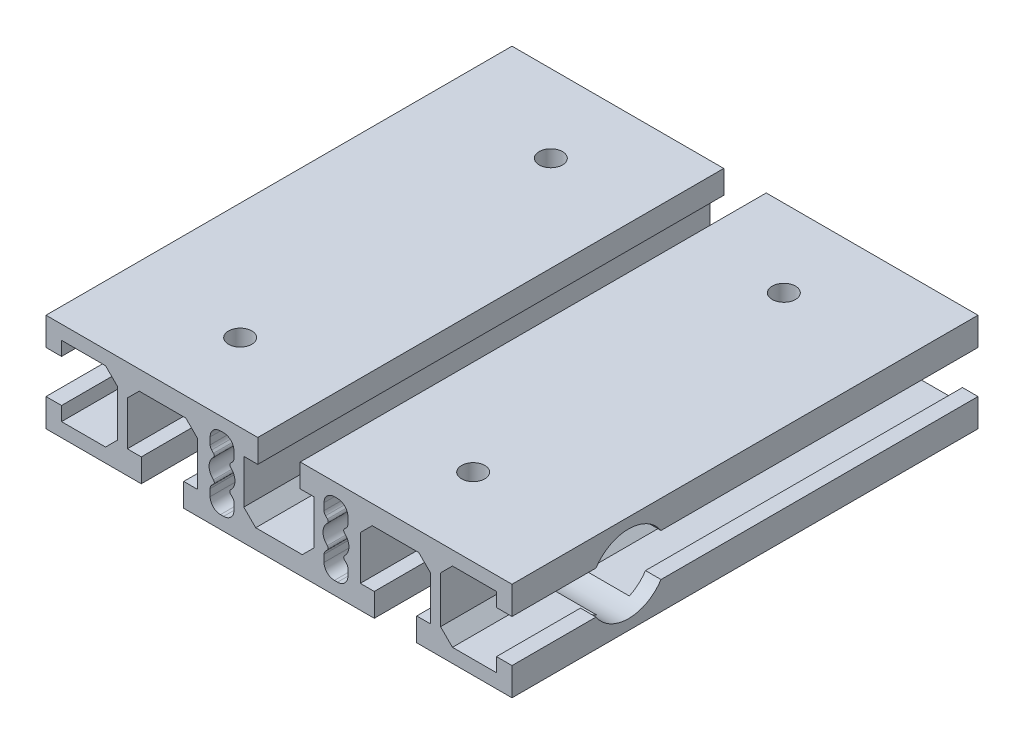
from build123d import *

# Parameters (mm, degrees)
BOSS_EXTRUDE1_DEPTH      = 45
BOSS_EXTRUDE1_DEPTH_BACK = 45
SKETCH2_R                = 2.25
CUT_EXTRUDE1_DEPTH       = 45
SKETCH3_R                = 7.5
CUT_EXTRUDE2_DEPTH       = 16


with BuildPart() as part:
    # Sketch1 → Boss-Extrude1 (new, two sides: drawn at the far end of the back side and taken through both)
    with BuildSketch(Plane.XY.offset(-BOSS_EXTRUDE1_DEPTH_BACK)):
        Polygon((-15.7, 3.5), (-15.7, -5), (-18.4, -5), (-18.4, -9.5), (18.4, -9.5), (18.4, -5), (15.7, -5), (15.7, 3.5), (18, 5.8), (27, 5.8), (29.3, 3.5), (29.3, -5), (26.6, -5), (26.6, -9.5), (45, -9.5), (45, -4.1), (42, -4.1), (42, -6.8), (33.5, -6.8), (31.2, -4.5), (31.2, 4.5), (33.5, 6.8), (42, 6.8), (42, 4.1), (45, 4.1), (45, 9.5), (4.1, 9.5), (4.1, 5), (6.8, 5), (6.8, -3.5), (4.5, -5.8), (-4.5, -5.8), (-6.8, -3.5), (-6.8, 5), (-4.1, 5), (-4.1, 9.5), (-45, 9.5), (-45, 4.1), (-42, 4.1), (-42, 6.8), (-33.5, 6.8), (-31.2, 4.5), (-31.2, -4.5), (-33.5, -6.8), (-42, -6.8), (-42, -4.1), (-45, -4.1), (-45, -9.5), (-26.6, -9.5), (-26.6, -5), (-29.3, -5), (-29.3, 3.5), (-27, 5.8), (-18, 5.8), align=None)
        with BuildLine():
            Line((-13.299970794, -4.999975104), (-13.299970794, -3.657373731))
            ThreePointArc((-13.299970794, -3.657373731), (-13.223850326, -3.274690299), (-13.007077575, -2.95026695))
            Line((-13.007077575, -2.95026695), (-12.646417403, -2.589606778))
            ThreePointArc((-12.646417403, -2.589606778), (-12.500164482, -2.222137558), (-12.66663746, -1.863375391))
            ThreePointArc((-12.66663746, -1.863375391), (-13.499970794, 1.459e-05), (-12.66663746, 1.863404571))
            ThreePointArc((-12.66663746, 1.863404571), (-12.500164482, 2.222166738), (-12.646417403, 2.589635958))
            Line((-12.646417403, 2.589635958), (-13.007077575, 2.95029613))
            ThreePointArc((-13.007077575, 2.95029613), (-13.223850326, 3.274719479), (-13.299970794, 3.657402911))
            Line((-13.299970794, 3.657402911), (-13.299970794, 5.000004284))
            ThreePointArc((-13.299970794, 5.000004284), (-12.714184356, 6.414217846), (-11.299970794, 7.000004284))
            Line((-11.299970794, 7.000004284), (-10.699970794, 7.000004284))
            ThreePointArc((-10.699970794, 7.000004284), (-9.285757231, 6.414217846), (-8.699970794, 5.000004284))
            Line((-8.699970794, 5.000004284), (-8.699970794, 3.657402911))
            ThreePointArc((-8.699970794, 3.657402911), (-8.776091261, 3.274719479), (-8.992864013, 2.95029613))
            Line((-8.992864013, 2.95029613), (-9.353524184, 2.589635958))
            ThreePointArc((-9.353524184, 2.589635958), (-9.499777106, 2.222166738), (-9.333304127, 1.863404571))
            ThreePointArc((-9.333304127, 1.863404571), (-8.499970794, 1.459e-05), (-9.333304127, -1.863375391))
            ThreePointArc((-9.333304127, -1.863375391), (-9.499777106, -2.222137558), (-9.353524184, -2.589606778))
            Line((-9.353524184, -2.589606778), (-8.992864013, -2.95026695))
            ThreePointArc((-8.992864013, -2.95026695), (-8.776091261, -3.274690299), (-8.699970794, -3.657373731))
            Line((-8.699970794, -3.657373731), (-8.699970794, -4.999975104))
            ThreePointArc((-8.699970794, -4.999975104), (-9.285757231, -6.414188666), (-10.699970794, -6.999975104))
            Line((-10.699970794, -6.999975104), (-11.299970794, -6.999975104))
            ThreePointArc((-11.299970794, -6.999975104), (-12.714184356, -6.414188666), (-13.299970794, -4.999975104))
        make_face(mode=Mode.SUBTRACT)
        with BuildLine():
            Line((13.007077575, 2.95029613), (12.646417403, 2.589635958))
            ThreePointArc((12.646417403, 2.589635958), (12.500164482, 2.222166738), (12.66663746, 1.863404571))
            ThreePointArc((12.66663746, 1.863404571), (13.499970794, 1.459e-05), (12.66663746, -1.863375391))
            ThreePointArc((12.66663746, -1.863375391), (12.500164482, -2.222137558), (12.646417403, -2.589606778))
            Line((12.646417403, -2.589606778), (13.007077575, -2.95026695))
            ThreePointArc((13.007077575, -2.95026695), (13.223850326, -3.274690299), (13.299970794, -3.657373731))
            Line((13.299970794, -3.657373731), (13.299970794, -4.999975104))
            ThreePointArc((13.299970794, -4.999975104), (12.714184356, -6.414188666), (11.299970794, -6.999975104))
            Line((11.299970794, -6.999975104), (10.699970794, -6.999975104))
            ThreePointArc((10.699970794, -6.999975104), (9.285757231, -6.414188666), (8.699970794, -4.999975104))
            Line((8.699970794, -4.999975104), (8.699970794, -3.657373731))
            ThreePointArc((8.699970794, -3.657373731), (8.776091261, -3.274690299), (8.992864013, -2.95026695))
            Line((8.992864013, -2.95026695), (9.353524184, -2.589606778))
            ThreePointArc((9.353524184, -2.589606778), (9.499777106, -2.222137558), (9.333304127, -1.863375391))
            ThreePointArc((9.333304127, -1.863375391), (8.499970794, 1.459e-05), (9.333304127, 1.863404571))
            ThreePointArc((9.333304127, 1.863404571), (9.499777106, 2.222166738), (9.353524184, 2.589635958))
            Line((9.353524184, 2.589635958), (8.992864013, 2.95029613))
            ThreePointArc((8.992864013, 2.95029613), (8.776091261, 3.274719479), (8.699970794, 3.657402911))
            Line((8.699970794, 3.657402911), (8.699970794, 5.000004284))
            ThreePointArc((8.699970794, 5.000004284), (9.285757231, 6.414217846), (10.699970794, 7.000004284))
            Line((10.699970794, 7.000004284), (11.299970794, 7.000004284))
            ThreePointArc((11.299970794, 7.000004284), (12.714184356, 6.414217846), (13.299970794, 5.000004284))
            Line((13.299970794, 5.000004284), (13.299970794, 3.657402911))
            ThreePointArc((13.299970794, 3.657402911), (13.223850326, 3.274719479), (13.007077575, 2.95029613))
        make_face(mode=Mode.SUBTRACT)
    extrude(amount=BOSS_EXTRUDE1_DEPTH + BOSS_EXTRUDE1_DEPTH_BACK)

    # Sketch2 → Cut-Extrude1 (cut)
    with BuildSketch(Plane(origin=(0, 9.5, 0), x_dir=(1, 0, 0), z_dir=(0, 1, 0))):
        with Locations(Location((-22.5, 30, 0), (0, 0, 270))):
            Circle(SKETCH2_R)
        with Locations(Location((-22.5, -30, 0), (0, 0, 270))):
            Circle(SKETCH2_R)
        with Locations(Location((22.5, -30, 0), (0, 0, 270))):
            Circle(SKETCH2_R)
        with Locations(Location((22.5, 30, 0), (0, 0, 270))):
            Circle(SKETCH2_R)
    extrude(amount=-CUT_EXTRUDE1_DEPTH, mode=Mode.SUBTRACT)

    # Sketch3 → Cut-Extrude2 (cut)
    with BuildSketch(Plane.ZY.offset(45)):
        with Locations(Location((22.5, 0, 0), (0, 0, 27.818139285))):
            Circle(SKETCH3_R)
    cut_extrude2 = extrude(amount=-CUT_EXTRUDE2_DEPTH, mode=Mode.SUBTRACT)

    # Mirror1: Cut-Extrude2 across plane
    add(cut_extrude2.mirror(Plane(origin=(0, 0, 0), x_dir=(0, 0, 1), z_dir=(1, 0, 0))), mode=Mode.SUBTRACT)


solid = part.part
